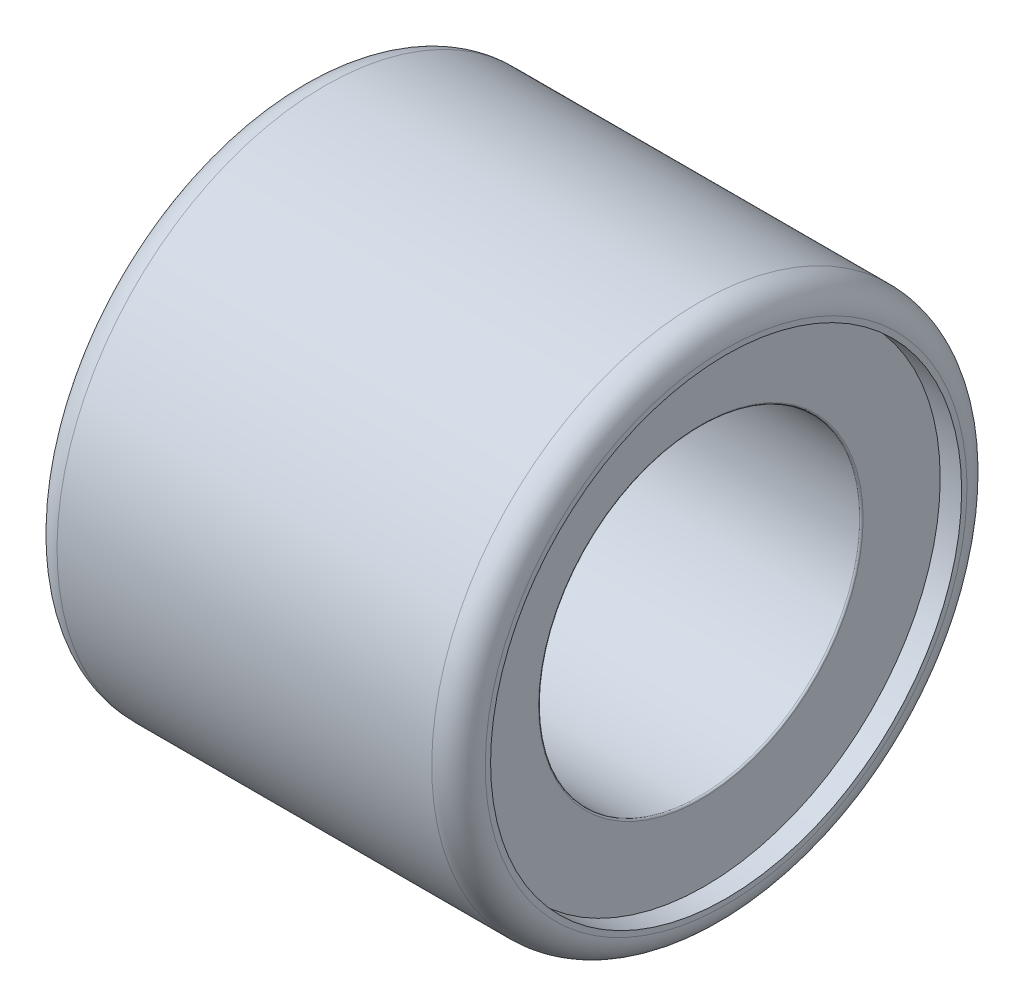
from build123d import *


with BuildPart() as part:
    # InnRacSke → Race (revolve)
    with BuildSketch(Plane.XY):
        with BuildLine():
            Line((-3.6, 4.4), (-4, 4.4))
            Line((-4, 4.4), (-4, 4.5))
            ThreePointArc((-4, 4.5), (-3.853553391, 4.853553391), (-3.5, 5))
            Line((-3.5, 5), (3.5, 5))
            ThreePointArc((3.5, 5), (3.853553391, 4.853553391), (4, 4.5))
            Line((4, 4.5), (4, 4.4))
            Line((4, 4.4), (3.6, 4.4))
            Line((3.6, 4.4), (3.6, 4.6))
            Line((3.6, 4.6), (-3.6, 4.6))
            Line((-3.6, 4.6), (-3.6, 4.4))
        make_face()
    revolve(axis=Axis((-31.75, 0, 0), (1, 0, 0)))

    # RolSimSke → RollersSimplified (revolve)
    with BuildSketch(Plane.XY, mode=Mode.PRIVATE) as rollerssimplified_sk:
        with BuildLine():
            Line((-3.49598, 4.601), (3.49598, 4.601))
            ThreePointArc((3.49598, 4.601), (3.518621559, 4.591621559), (3.528, 4.56898))
            Line((3.528, 4.56898), (3.528, 3.03202))
            ThreePointArc((3.528, 3.03202), (3.518621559, 3.009378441), (3.49598, 3))
            Line((3.49598, 3), (-3.49598, 3))
            ThreePointArc((-3.49598, 3), (-3.518621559, 3.009378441), (-3.528, 3.03202))
            Line((-3.528, 3.03202), (-3.528, 4.56898))
            ThreePointArc((-3.528, 4.56898), (-3.518621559, 4.591621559), (-3.49598, 4.601))
        make_face()
    revolve(rollerssimplified_sk.sketch.rotate(Axis((-25.4, 0, 0), (1, 0, 0)), 90), axis=Axis((-25.4, 0, 0), (1, 0, 0)))


solid = part.part
